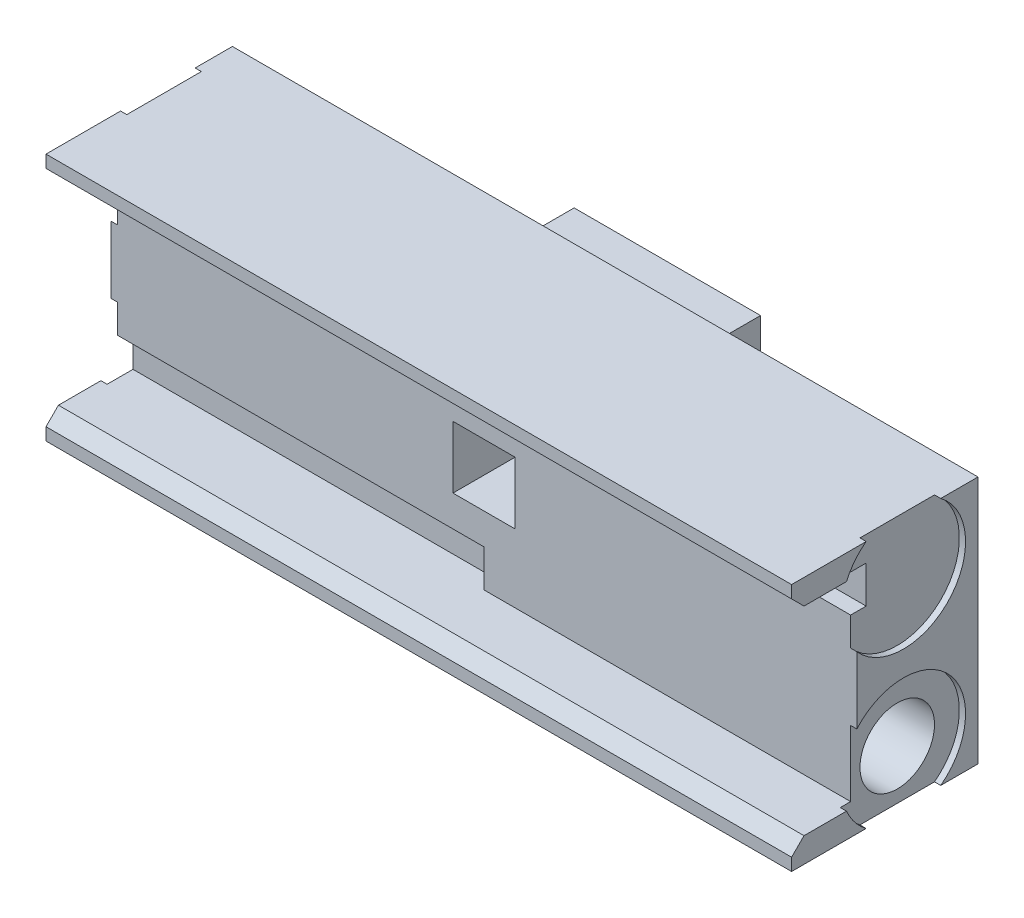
ISO-10303-21;
HEADER;
FILE_DESCRIPTION(('STEP AP214'),'2;1');
FILE_NAME('part.step','',(''),(''),'','','');
FILE_SCHEMA(('AUTOMOTIVE_DESIGN { 1 0 10303 214 1 1 1 1 }'));
ENDSEC;
DATA;
#1=APPLICATION_CONTEXT('core data for automotive mechanical design processes');
#2=APPLICATION_PROTOCOL_DEFINITION('international standard','automotive_design',2000,#1);
#3=PRODUCT_CONTEXT('',#1,'mechanical');
#4=PRODUCT('Part','Part','',(#3));
#5=PRODUCT_RELATED_PRODUCT_CATEGORY('part','',(#4));
#6=PRODUCT_DEFINITION_FORMATION('','',#4);
#7=PRODUCT_DEFINITION_CONTEXT('part definition',#1,'design');
#8=PRODUCT_DEFINITION('design','',#6,#7);
#9=PRODUCT_DEFINITION_SHAPE('','',#8);
#10=(LENGTH_UNIT() NAMED_UNIT(*) SI_UNIT(.MILLI.,.METRE.));
#11=(NAMED_UNIT(*) PLANE_ANGLE_UNIT() SI_UNIT($,.RADIAN.));
#12=(NAMED_UNIT(*) SI_UNIT($,.STERADIAN.) SOLID_ANGLE_UNIT());
#13=UNCERTAINTY_MEASURE_WITH_UNIT(LENGTH_MEASURE(1.E-05),#10,'distance_accuracy_value','');
#14=(GEOMETRIC_REPRESENTATION_CONTEXT(3) GLOBAL_UNCERTAINTY_ASSIGNED_CONTEXT((#13)) GLOBAL_UNIT_ASSIGNED_CONTEXT((#10,
#11,#12)) REPRESENTATION_CONTEXT('',''));
#15=CARTESIAN_POINT('',(0.,0.,0.));
#16=DIRECTION('',(0.,0.,1.));
#17=DIRECTION('',(1.,0.,0.));
#18=AXIS2_PLACEMENT_3D('',#15,#16,#17);
#19=CARTESIAN_POINT('',(-60.,20.,30.));
#20=DIRECTION('',(0.,-1.,0.));
#21=DIRECTION('',(0.,0.,-1.));
#22=AXIS2_PLACEMENT_3D('',#19,#20,#21);
#23=PLANE('',#22);
#24=DIRECTION('',(-1.,0.,0.));
#25=VECTOR('',#24,1.);
#26=CARTESIAN_POINT('',(-59.,20.,18.));
#27=LINE('',#26,#25);
#28=CARTESIAN_POINT('',(-60.,20.,18.));
#29=VERTEX_POINT('',#28);
#30=CARTESIAN_POINT('',(-59.,20.,18.));
#31=VERTEX_POINT('',#30);
#32=EDGE_CURVE('E373',#29,#31,#27,.F.);
#33=ORIENTED_EDGE('',*,*,#32,.F.);
#34=DIRECTION('',(0.,0.,-1.));
#35=VECTOR('',#34,1.);
#36=CARTESIAN_POINT('',(-60.,20.,30.));
#37=LINE('',#36,#35);
#38=CARTESIAN_POINT('',(-60.,20.,30.));
#39=VERTEX_POINT('',#38);
#40=EDGE_CURVE('E551',#39,#29,#37,.T.);
#41=ORIENTED_EDGE('',*,*,#40,.F.);
#42=DIRECTION('',(-1.,0.,0.));
#43=VECTOR('',#42,1.);
#44=CARTESIAN_POINT('',(-60.,20.,30.));
#45=LINE('',#44,#43);
#46=CARTESIAN_POINT('',(60.,20.,30.));
#47=VERTEX_POINT('',#46);
#48=EDGE_CURVE('E522',#47,#39,#45,.T.);
#49=ORIENTED_EDGE('',*,*,#48,.F.);
#50=DIRECTION('',(0.,0.,-1.));
#51=VECTOR('',#50,1.);
#52=CARTESIAN_POINT('',(60.,20.,30.));
#53=LINE('',#52,#51);
#54=CARTESIAN_POINT('',(60.,20.,18.));
#55=VERTEX_POINT('',#54);
#56=EDGE_CURVE('E555',#47,#55,#53,.T.);
#57=ORIENTED_EDGE('',*,*,#56,.T.);
#58=DIRECTION('',(1.,0.,0.));
#59=VECTOR('',#58,1.);
#60=CARTESIAN_POINT('',(59.,20.,18.));
#61=LINE('',#60,#59);
#62=CARTESIAN_POINT('',(59.,20.,18.));
#63=VERTEX_POINT('',#62);
#64=EDGE_CURVE('E419',#55,#63,#61,.F.);
#65=ORIENTED_EDGE('',*,*,#64,.T.);
#66=DIRECTION('',(0.,0.,1.));
#67=VECTOR('',#66,1.);
#68=CARTESIAN_POINT('',(59.,20.,30.));
#69=LINE('',#68,#67);
#70=CARTESIAN_POINT('',(59.,20.,6.00000000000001));
#71=VERTEX_POINT('',#70);
#72=EDGE_CURVE('E414',#71,#63,#69,.T.);
#73=ORIENTED_EDGE('',*,*,#72,.F.);
#74=DIRECTION('',(1.,0.,0.));
#75=VECTOR('',#74,1.);
#76=CARTESIAN_POINT('',(59.,20.,6.00000000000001));
#77=LINE('',#76,#75);
#78=CARTESIAN_POINT('',(60.,20.,6.00000000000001));
#79=VERTEX_POINT('',#78);
#80=EDGE_CURVE('E422',#71,#79,#77,.T.);
#81=ORIENTED_EDGE('',*,*,#80,.T.);
#82=CARTESIAN_POINT('',(60.,20.,0.));
#83=VERTEX_POINT('',#82);
#84=EDGE_CURVE('E554',#79,#83,#53,.T.);
#85=ORIENTED_EDGE('',*,*,#84,.T.);
#86=DIRECTION('',(-1.,0.,0.));
#87=VECTOR('',#86,1.);
#88=CARTESIAN_POINT('',(-60.,20.,0.));
#89=LINE('',#88,#87);
#90=CARTESIAN_POINT('',(-60.,20.,0.));
#91=VERTEX_POINT('',#90);
#92=EDGE_CURVE('E534',#83,#91,#89,.T.);
#93=ORIENTED_EDGE('',*,*,#92,.T.);
#94=CARTESIAN_POINT('',(-60.,20.,6.00000000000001));
#95=VERTEX_POINT('',#94);
#96=EDGE_CURVE('E550',#95,#91,#37,.T.);
#97=ORIENTED_EDGE('',*,*,#96,.F.);
#98=DIRECTION('',(-1.,0.,0.));
#99=VECTOR('',#98,1.);
#100=CARTESIAN_POINT('',(-59.,20.,6.00000000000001));
#101=LINE('',#100,#99);
#102=CARTESIAN_POINT('',(-59.,20.,6.00000000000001));
#103=VERTEX_POINT('',#102);
#104=EDGE_CURVE('E371',#103,#95,#101,.T.);
#105=ORIENTED_EDGE('',*,*,#104,.F.);
#106=DIRECTION('',(0.,0.,-1.));
#107=VECTOR('',#106,1.);
#108=CARTESIAN_POINT('',(-59.,20.,30.));
#109=LINE('',#108,#107);
#110=EDGE_CURVE('E366',#31,#103,#109,.T.);
#111=ORIENTED_EDGE('',*,*,#110,.F.);
#112=EDGE_LOOP('',(#33,#41,#49,#57,#65,#73,#81,#85,#93,#97,#105,#111));
#113=FACE_BOUND('',#112,.T.);
#114=ADVANCED_FACE('F32',(#113),#23,.F.);
#115=CARTESIAN_POINT('',(-60.,-20.,30.));
#116=DIRECTION('',(1.,0.,0.));
#117=DIRECTION('',(0.,0.,-1.));
#118=AXIS2_PLACEMENT_3D('',#115,#116,#117);
#119=PLANE('',#118);
#120=DIRECTION('',(0.,0.,-1.));
#121=VECTOR('',#120,1.);
#122=CARTESIAN_POINT('',(-60.,16.,30.));
#123=LINE('',#122,#121);
#124=CARTESIAN_POINT('',(-60.,16.,28.));
#125=VERTEX_POINT('',#124);
#126=CARTESIAN_POINT('',(-60.,16.,21.1651513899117));
#127=VERTEX_POINT('',#126);
#128=EDGE_CURVE('E458',#125,#127,#123,.T.);
#129=ORIENTED_EDGE('',*,*,#128,.F.);
#130=DIRECTION('',(0.,-0.707106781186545,-0.70710678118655));
#131=VECTOR('',#130,1.);
#132=CARTESIAN_POINT('',(-60.,18.,30.));
#133=LINE('',#132,#131);
#134=CARTESIAN_POINT('',(-60.,18.,30.));
#135=VERTEX_POINT('',#134);
#136=EDGE_CURVE('E584',#125,#135,#133,.F.);
#137=ORIENTED_EDGE('',*,*,#136,.T.);
#138=DIRECTION('',(0.,-1.,0.));
#139=VECTOR('',#138,1.);
#140=CARTESIAN_POINT('',(-60.,-20.,30.));
#141=LINE('',#140,#139);
#142=EDGE_CURVE('E526',#39,#135,#141,.T.);
#143=ORIENTED_EDGE('',*,*,#142,.F.);
#144=ORIENTED_EDGE('',*,*,#40,.T.);
#145=CARTESIAN_POINT('',(-60.,12.,12.));
#146=DIRECTION('',(1.,0.,0.));
#147=DIRECTION('',(0.,0.,-1.));
#148=AXIS2_PLACEMENT_3D('',#145,#146,#147);
#149=CIRCLE('',#148,10.);
#150=EDGE_CURVE('E339',#29,#127,#149,.T.);
#151=ORIENTED_EDGE('',*,*,#150,.T.);
#152=EDGE_LOOP('',(#129,#137,#143,#144,#151));
#153=FACE_BOUND('',#152,.T.);
#154=ADVANCED_FACE('F659',(#153),#119,.F.);
#155=CARTESIAN_POINT('',(-60.,-18.,30.));
#156=VERTEX_POINT('',#155);
#157=CARTESIAN_POINT('',(-60.,-20.,30.));
#158=VERTEX_POINT('',#157);
#159=EDGE_CURVE('E525',#156,#158,#141,.T.);
#160=ORIENTED_EDGE('',*,*,#159,.F.);
#161=DIRECTION('',(0.,-0.70710678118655,0.707106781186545));
#162=VECTOR('',#161,1.);
#163=CARTESIAN_POINT('',(-60.,-16.,28.));
#164=LINE('',#163,#162);
#165=CARTESIAN_POINT('',(-60.,-16.,28.));
#166=VERTEX_POINT('',#165);
#167=EDGE_CURVE('E11',#156,#166,#164,.F.);
#168=ORIENTED_EDGE('',*,*,#167,.T.);
#169=DIRECTION('',(0.,0.,1.));
#170=VECTOR('',#169,1.);
#171=CARTESIAN_POINT('',(-60.,-16.,30.));
#172=LINE('',#171,#170);
#173=CARTESIAN_POINT('',(-60.,-16.,21.1651513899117));
#174=VERTEX_POINT('',#173);
#175=EDGE_CURVE('E462',#174,#166,#172,.T.);
#176=ORIENTED_EDGE('',*,*,#175,.F.);
#177=CARTESIAN_POINT('',(-60.,-12.,12.));
#178=DIRECTION('',(1.,0.,0.));
#179=DIRECTION('',(0.,0.,-1.));
#180=AXIS2_PLACEMENT_3D('',#177,#178,#179);
#181=CIRCLE('',#180,10.);
#182=CARTESIAN_POINT('',(-60.,-20.,18.));
#183=VERTEX_POINT('',#182);
#184=EDGE_CURVE('E347',#174,#183,#181,.T.);
#185=ORIENTED_EDGE('',*,*,#184,.T.);
#186=DIRECTION('',(0.,0.,-1.));
#187=VECTOR('',#186,1.);
#188=CARTESIAN_POINT('',(-60.,-20.,30.));
#189=LINE('',#188,#187);
#190=EDGE_CURVE('E547',#158,#183,#189,.T.);
#191=ORIENTED_EDGE('',*,*,#190,.F.);
#192=EDGE_LOOP('',(#160,#168,#176,#185,#191));
#193=FACE_BOUND('',#192,.T.);
#194=ADVANCED_FACE('F710',(#193),#119,.F.);
#195=CARTESIAN_POINT('',(-60.,-20.,30.));
#196=DIRECTION('',(0.,1.,0.));
#197=DIRECTION('',(0.,0.,1.));
#198=AXIS2_PLACEMENT_3D('',#195,#196,#197);
#199=PLANE('',#198);
#200=DIRECTION('',(-1.,0.,0.));
#201=VECTOR('',#200,1.);
#202=CARTESIAN_POINT('',(-59.,-20.,5.99999999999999));
#203=LINE('',#202,#201);
#204=CARTESIAN_POINT('',(-60.,-20.,5.99999999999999));
#205=VERTEX_POINT('',#204);
#206=CARTESIAN_POINT('',(-59.,-20.,5.99999999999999));
#207=VERTEX_POINT('',#206);
#208=EDGE_CURVE('E362',#205,#207,#203,.F.);
#209=ORIENTED_EDGE('',*,*,#208,.F.);
#210=CARTESIAN_POINT('',(-60.,-20.,0.));
#211=VERTEX_POINT('',#210);
#212=EDGE_CURVE('E546',#205,#211,#189,.T.);
#213=ORIENTED_EDGE('',*,*,#212,.T.);
#214=DIRECTION('',(1.,0.,0.));
#215=VECTOR('',#214,1.);
#216=CARTESIAN_POINT('',(-60.,-20.,0.));
#217=LINE('',#216,#215);
#218=CARTESIAN_POINT('',(60.,-20.,0.));
#219=VERTEX_POINT('',#218);
#220=EDGE_CURVE('E540',#211,#219,#217,.T.);
#221=ORIENTED_EDGE('',*,*,#220,.T.);
#222=DIRECTION('',(0.,0.,-1.));
#223=VECTOR('',#222,1.);
#224=CARTESIAN_POINT('',(60.,-20.,30.));
#225=LINE('',#224,#223);
#226=CARTESIAN_POINT('',(60.,-20.,5.99999999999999));
#227=VERTEX_POINT('',#226);
#228=EDGE_CURVE('E531',#227,#219,#225,.T.);
#229=ORIENTED_EDGE('',*,*,#228,.F.);
#230=DIRECTION('',(1.,0.,0.));
#231=VECTOR('',#230,1.);
#232=CARTESIAN_POINT('',(59.,-20.,5.99999999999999));
#233=LINE('',#232,#231);
#234=CARTESIAN_POINT('',(59.,-20.,5.99999999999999));
#235=VERTEX_POINT('',#234);
#236=EDGE_CURVE('E402',#227,#235,#233,.F.);
#237=ORIENTED_EDGE('',*,*,#236,.T.);
#238=DIRECTION('',(0.,0.,-1.));
#239=VECTOR('',#238,1.);
#240=CARTESIAN_POINT('',(59.,-20.,30.));
#241=LINE('',#240,#239);
#242=CARTESIAN_POINT('',(59.,-20.,18.));
#243=VERTEX_POINT('',#242);
#244=EDGE_CURVE('E397',#243,#235,#241,.T.);
#245=ORIENTED_EDGE('',*,*,#244,.F.);
#246=DIRECTION('',(1.,0.,0.));
#247=VECTOR('',#246,1.);
#248=CARTESIAN_POINT('',(59.,-20.,18.));
#249=LINE('',#248,#247);
#250=CARTESIAN_POINT('',(60.,-20.,18.));
#251=VERTEX_POINT('',#250);
#252=EDGE_CURVE('E405',#243,#251,#249,.T.);
#253=ORIENTED_EDGE('',*,*,#252,.T.);
#254=CARTESIAN_POINT('',(60.,-20.,30.));
#255=VERTEX_POINT('',#254);
#256=EDGE_CURVE('E543',#255,#251,#225,.T.);
#257=ORIENTED_EDGE('',*,*,#256,.F.);
#258=DIRECTION('',(1.,0.,0.));
#259=VECTOR('',#258,1.);
#260=CARTESIAN_POINT('',(-60.,-20.,30.));
#261=LINE('',#260,#259);
#262=EDGE_CURVE('E529',#158,#255,#261,.T.);
#263=ORIENTED_EDGE('',*,*,#262,.F.);
#264=ORIENTED_EDGE('',*,*,#190,.T.);
#265=DIRECTION('',(-1.,0.,0.));
#266=VECTOR('',#265,1.);
#267=CARTESIAN_POINT('',(-59.,-20.,18.));
#268=LINE('',#267,#266);
#269=CARTESIAN_POINT('',(-59.,-20.,18.));
#270=VERTEX_POINT('',#269);
#271=EDGE_CURVE('E360',#270,#183,#268,.T.);
#272=ORIENTED_EDGE('',*,*,#271,.F.);
#273=DIRECTION('',(0.,0.,1.));
#274=VECTOR('',#273,1.);
#275=CARTESIAN_POINT('',(-59.,-20.,30.));
#276=LINE('',#275,#274);
#277=EDGE_CURVE('E356',#207,#270,#276,.T.);
#278=ORIENTED_EDGE('',*,*,#277,.F.);
#279=EDGE_LOOP('',(#209,#213,#221,#229,#237,#245,#253,#257,#263,#264,#272,#278));
#280=FACE_BOUND('',#279,.T.);
#281=ADVANCED_FACE('F607',(#280),#199,.F.);
#282=CARTESIAN_POINT('',(0.,16.,30.));
#283=DIRECTION('',(0.,1.,0.));
#284=DIRECTION('',(0.,0.,1.));
#285=AXIS2_PLACEMENT_3D('',#282,#283,#284);
#286=PLANE('',#285);
#287=DIRECTION('',(0.,0.,1.));
#288=VECTOR('',#287,1.);
#289=CARTESIAN_POINT('',(60.,16.,30.));
#290=LINE('',#289,#288);
#291=CARTESIAN_POINT('',(60.,16.,21.1651513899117));
#292=VERTEX_POINT('',#291);
#293=CARTESIAN_POINT('',(60.,16.,28.));
#294=VERTEX_POINT('',#293);
#295=EDGE_CURVE('E492',#292,#294,#290,.T.);
#296=ORIENTED_EDGE('',*,*,#295,.T.);
#297=DIRECTION('',(-1.,0.,0.));
#298=VECTOR('',#297,1.);
#299=CARTESIAN_POINT('',(0.,16.,28.));
#300=LINE('',#299,#298);
#301=EDGE_CURVE('E582',#294,#125,#300,.T.);
#302=ORIENTED_EDGE('',*,*,#301,.T.);
#303=ORIENTED_EDGE('',*,*,#128,.T.);
#304=DIRECTION('',(-1.,0.,0.));
#305=VECTOR('',#304,1.);
#306=CARTESIAN_POINT('',(-59.,16.,21.1651513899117));
#307=LINE('',#306,#305);
#308=CARTESIAN_POINT('',(-59.,16.,21.1651513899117));
#309=VERTEX_POINT('',#308);
#310=EDGE_CURVE('E368',#309,#127,#307,.T.);
#311=ORIENTED_EDGE('',*,*,#310,.F.);
#312=DIRECTION('',(0.,0.,1.));
#313=VECTOR('',#312,1.);
#314=CARTESIAN_POINT('',(-59.,16.,30.));
#315=LINE('',#314,#313);
#316=CARTESIAN_POINT('',(-59.,16.,19.5));
#317=VERTEX_POINT('',#316);
#318=EDGE_CURVE('E364',#317,#309,#315,.T.);
#319=ORIENTED_EDGE('',*,*,#318,.F.);
#320=DIRECTION('',(-1.,0.,0.));
#321=VECTOR('',#320,1.);
#322=CARTESIAN_POINT('',(0.,16.,19.5));
#323=LINE('',#322,#321);
#324=CARTESIAN_POINT('',(0.,16.,19.5));
#325=VERTEX_POINT('',#324);
#326=EDGE_CURVE('E470',#325,#317,#323,.T.);
#327=ORIENTED_EDGE('',*,*,#326,.F.);
#328=DIRECTION('',(0.,0.,1.));
#329=VECTOR('',#328,1.);
#330=CARTESIAN_POINT('',(0.,16.,19.7820675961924));
#331=LINE('',#330,#329);
#332=CARTESIAN_POINT('',(0.,16.,17.));
#333=VERTEX_POINT('',#332);
#334=EDGE_CURVE('E498',#333,#325,#331,.T.);
#335=ORIENTED_EDGE('',*,*,#334,.F.);
#336=DIRECTION('',(1.,0.,0.));
#337=VECTOR('',#336,1.);
#338=CARTESIAN_POINT('',(0.,16.,17.));
#339=LINE('',#338,#337);
#340=CARTESIAN_POINT('',(59.,16.,17.));
#341=VERTEX_POINT('',#340);
#342=EDGE_CURVE('E508',#333,#341,#339,.T.);
#343=ORIENTED_EDGE('',*,*,#342,.T.);
#344=DIRECTION('',(0.,0.,-1.));
#345=VECTOR('',#344,1.);
#346=CARTESIAN_POINT('',(59.,16.,30.));
#347=LINE('',#346,#345);
#348=CARTESIAN_POINT('',(59.,16.,21.1651513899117));
#349=VERTEX_POINT('',#348);
#350=EDGE_CURVE('E412',#349,#341,#347,.T.);
#351=ORIENTED_EDGE('',*,*,#350,.F.);
#352=DIRECTION('',(1.,0.,0.));
#353=VECTOR('',#352,1.);
#354=CARTESIAN_POINT('',(59.,16.,21.1651513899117));
#355=LINE('',#354,#353);
#356=EDGE_CURVE('E416',#349,#292,#355,.T.);
#357=ORIENTED_EDGE('',*,*,#356,.T.);
#358=EDGE_LOOP('',(#296,#302,#303,#311,#319,#327,#335,#343,#351,#357));
#359=FACE_BOUND('',#358,.T.);
#360=ADVANCED_FACE('F642',(#359),#286,.F.);
#361=CARTESIAN_POINT('',(0.,10.,19.5));
#362=DIRECTION('',(0.,0.,-1.));
#363=DIRECTION('',(0.,1.,0.));
#364=AXIS2_PLACEMENT_3D('',#361,#362,#363);
#365=PLANE('',#364);
#366=DIRECTION('',(-1.,0.,0.));
#367=VECTOR('',#366,1.);
#368=CARTESIAN_POINT('',(-5.,5.,19.5));
#369=LINE('',#368,#367);
#370=CARTESIAN_POINT('',(5.,5.,19.5));
#371=VERTEX_POINT('',#370);
#372=CARTESIAN_POINT('',(-5.,5.,19.5));
#373=VERTEX_POINT('',#372);
#374=EDGE_CURVE('E324',#371,#373,#369,.T.);
#375=ORIENTED_EDGE('',*,*,#374,.F.);
#376=DIRECTION('',(0.,1.,0.));
#377=VECTOR('',#376,1.);
#378=CARTESIAN_POINT('',(5.,-5.,19.5));
#379=LINE('',#378,#377);
#380=CARTESIAN_POINT('',(5.,-5.,19.5));
#381=VERTEX_POINT('',#380);
#382=EDGE_CURVE('E295',#381,#371,#379,.T.);
#383=ORIENTED_EDGE('',*,*,#382,.F.);
#384=DIRECTION('',(1.,0.,0.));
#385=VECTOR('',#384,1.);
#386=CARTESIAN_POINT('',(-5.,-5.,19.5));
#387=LINE('',#386,#385);
#388=CARTESIAN_POINT('',(-5.,-5.,19.5));
#389=VERTEX_POINT('',#388);
#390=EDGE_CURVE('E312',#389,#381,#387,.T.);
#391=ORIENTED_EDGE('',*,*,#390,.F.);
#392=DIRECTION('',(0.,-1.,0.));
#393=VECTOR('',#392,1.);
#394=CARTESIAN_POINT('',(-5.,-5.,19.5));
#395=LINE('',#394,#393);
#396=EDGE_CURVE('E315',#373,#389,#395,.T.);
#397=ORIENTED_EDGE('',*,*,#396,.F.);
#398=EDGE_LOOP('',(#375,#383,#391,#397));
#399=FACE_BOUND('',#398,.T.);
#400=DIRECTION('',(-1.,0.,0.));
#401=VECTOR('',#400,1.);
#402=CARTESIAN_POINT('',(-59.,5.38562172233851,19.5));
#403=LINE('',#402,#401);
#404=CARTESIAN_POINT('',(-60.,5.38562172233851,19.5));
#405=VERTEX_POINT('',#404);
#406=CARTESIAN_POINT('',(-59.,5.38562172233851,19.5));
#407=VERTEX_POINT('',#406);
#408=EDGE_CURVE('E574',#405,#407,#403,.F.);
#409=ORIENTED_EDGE('',*,*,#408,.F.);
#410=DIRECTION('',(0.,-1.,0.));
#411=VECTOR('',#410,1.);
#412=CARTESIAN_POINT('',(-60.,16.,19.5));
#413=LINE('',#412,#411);
#414=CARTESIAN_POINT('',(-60.,-5.38562172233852,19.5));
#415=VERTEX_POINT('',#414);
#416=EDGE_CURVE('E472',#405,#415,#413,.T.);
#417=ORIENTED_EDGE('',*,*,#416,.T.);
#418=DIRECTION('',(-1.,0.,0.));
#419=VECTOR('',#418,1.);
#420=CARTESIAN_POINT('',(-59.,-5.38562172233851,19.5));
#421=LINE('',#420,#419);
#422=CARTESIAN_POINT('',(-59.,-5.38562172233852,19.5));
#423=VERTEX_POINT('',#422);
#424=EDGE_CURVE('E358',#423,#415,#421,.T.);
#425=ORIENTED_EDGE('',*,*,#424,.F.);
#426=DIRECTION('',(0.,1.,0.));
#427=VECTOR('',#426,1.);
#428=CARTESIAN_POINT('',(-59.,10.,19.5));
#429=LINE('',#428,#427);
#430=CARTESIAN_POINT('',(-59.,-10.,19.5));
#431=VERTEX_POINT('',#430);
#432=EDGE_CURVE('E354',#431,#423,#429,.T.);
#433=ORIENTED_EDGE('',*,*,#432,.F.);
#434=DIRECTION('',(-1.,0.,0.));
#435=VECTOR('',#434,1.);
#436=CARTESIAN_POINT('',(0.,-10.,19.5));
#437=LINE('',#436,#435);
#438=CARTESIAN_POINT('',(0.,-10.,19.5));
#439=VERTEX_POINT('',#438);
#440=EDGE_CURVE('E484',#439,#431,#437,.T.);
#441=ORIENTED_EDGE('',*,*,#440,.F.);
#442=DIRECTION('',(0.,1.,0.));
#443=VECTOR('',#442,1.);
#444=CARTESIAN_POINT('',(0.,10.,19.5));
#445=LINE('',#444,#443);
#446=CARTESIAN_POINT('',(0.,-16.,19.5));
#447=VERTEX_POINT('',#446);
#448=EDGE_CURVE('E489',#447,#439,#445,.T.);
#449=ORIENTED_EDGE('',*,*,#448,.F.);
#450=DIRECTION('',(1.,0.,0.));
#451=VECTOR('',#450,1.);
#452=CARTESIAN_POINT('',(0.,-16.,19.5));
#453=LINE('',#452,#451);
#454=CARTESIAN_POINT('',(59.,-16.,19.5));
#455=VERTEX_POINT('',#454);
#456=EDGE_CURVE('E501',#447,#455,#453,.T.);
#457=ORIENTED_EDGE('',*,*,#456,.T.);
#458=DIRECTION('',(0.,-1.,0.));
#459=VECTOR('',#458,1.);
#460=CARTESIAN_POINT('',(59.,10.,19.5));
#461=LINE('',#460,#459);
#462=CARTESIAN_POINT('',(59.,-5.38562172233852,19.5));
#463=VERTEX_POINT('',#462);
#464=EDGE_CURVE('E395',#463,#455,#461,.T.);
#465=ORIENTED_EDGE('',*,*,#464,.F.);
#466=DIRECTION('',(1.,0.,0.));
#467=VECTOR('',#466,1.);
#468=CARTESIAN_POINT('',(59.,-5.38562172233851,19.5));
#469=LINE('',#468,#467);
#470=CARTESIAN_POINT('',(60.,-5.38562172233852,19.5));
#471=VERTEX_POINT('',#470);
#472=EDGE_CURVE('E399',#463,#471,#469,.T.);
#473=ORIENTED_EDGE('',*,*,#472,.T.);
#474=DIRECTION('',(0.,1.,0.));
#475=VECTOR('',#474,1.);
#476=CARTESIAN_POINT('',(60.,10.,19.5));
#477=LINE('',#476,#475);
#478=CARTESIAN_POINT('',(60.,5.38562172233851,19.5));
#479=VERTEX_POINT('',#478);
#480=EDGE_CURVE('E503',#471,#479,#477,.T.);
#481=ORIENTED_EDGE('',*,*,#480,.T.);
#482=DIRECTION('',(1.,0.,0.));
#483=VECTOR('',#482,1.);
#484=CARTESIAN_POINT('',(59.,5.38562172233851,19.5));
#485=LINE('',#484,#483);
#486=CARTESIAN_POINT('',(59.,5.38562172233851,19.5));
#487=VERTEX_POINT('',#486);
#488=EDGE_CURVE('E565',#479,#487,#485,.F.);
#489=ORIENTED_EDGE('',*,*,#488,.T.);
#490=DIRECTION('',(0.,-1.,0.));
#491=VECTOR('',#490,1.);
#492=CARTESIAN_POINT('',(59.,10.,19.5));
#493=LINE('',#492,#491);
#494=CARTESIAN_POINT('',(59.,10.,19.5));
#495=VERTEX_POINT('',#494);
#496=EDGE_CURVE('E563',#495,#487,#493,.T.);
#497=ORIENTED_EDGE('',*,*,#496,.F.);
#498=DIRECTION('',(1.,0.,0.));
#499=VECTOR('',#498,1.);
#500=CARTESIAN_POINT('',(0.,10.,19.5));
#501=LINE('',#500,#499);
#502=CARTESIAN_POINT('',(0.,10.,19.5));
#503=VERTEX_POINT('',#502);
#504=EDGE_CURVE('E515',#503,#495,#501,.T.);
#505=ORIENTED_EDGE('',*,*,#504,.F.);
#506=DIRECTION('',(0.,-1.,0.));
#507=VECTOR('',#506,1.);
#508=CARTESIAN_POINT('',(0.,16.,19.5));
#509=LINE('',#508,#507);
#510=EDGE_CURVE('E459',#325,#503,#509,.T.);
#511=ORIENTED_EDGE('',*,*,#510,.F.);
#512=ORIENTED_EDGE('',*,*,#326,.T.);
#513=DIRECTION('',(0.,1.,0.));
#514=VECTOR('',#513,1.);
#515=CARTESIAN_POINT('',(-59.,10.,19.5));
#516=LINE('',#515,#514);
#517=EDGE_CURVE('E572',#407,#317,#516,.T.);
#518=ORIENTED_EDGE('',*,*,#517,.F.);
#519=EDGE_LOOP('',(#409,#417,#425,#433,#441,#449,#457,#465,#473,#481,#489,#497,#505,#511,#512,#518));
#520=FACE_BOUND('',#519,.T.);
#521=ADVANCED_FACE('F620',(#399,#520),#365,.F.);
#522=CARTESIAN_POINT('',(0.,-16.,30.));
#523=DIRECTION('',(0.,-1.,0.));
#524=DIRECTION('',(0.,0.,-1.));
#525=AXIS2_PLACEMENT_3D('',#522,#523,#524);
#526=PLANE('',#525);
#527=ORIENTED_EDGE('',*,*,#175,.T.);
#528=DIRECTION('',(1.,0.,0.));
#529=VECTOR('',#528,1.);
#530=CARTESIAN_POINT('',(0.,-16.,28.));
#531=LINE('',#530,#529);
#532=CARTESIAN_POINT('',(60.,-16.,28.));
#533=VERTEX_POINT('',#532);
#534=EDGE_CURVE('E586',#166,#533,#531,.T.);
#535=ORIENTED_EDGE('',*,*,#534,.T.);
#536=DIRECTION('',(0.,0.,-1.));
#537=VECTOR('',#536,1.);
#538=CARTESIAN_POINT('',(60.,-16.,30.));
#539=LINE('',#538,#537);
#540=CARTESIAN_POINT('',(60.,-16.,21.1651513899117));
#541=VERTEX_POINT('',#540);
#542=EDGE_CURVE('E480',#533,#541,#539,.T.);
#543=ORIENTED_EDGE('',*,*,#542,.T.);
#544=DIRECTION('',(1.,0.,0.));
#545=VECTOR('',#544,1.);
#546=CARTESIAN_POINT('',(59.,-16.,21.1651513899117));
#547=LINE('',#546,#545);
#548=CARTESIAN_POINT('',(59.,-16.,21.1651513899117));
#549=VERTEX_POINT('',#548);
#550=EDGE_CURVE('E560',#541,#549,#547,.F.);
#551=ORIENTED_EDGE('',*,*,#550,.T.);
#552=DIRECTION('',(0.,0.,1.));
#553=VECTOR('',#552,1.);
#554=CARTESIAN_POINT('',(59.,-16.,30.));
#555=LINE('',#554,#553);
#556=EDGE_CURVE('E558',#455,#549,#555,.T.);
#557=ORIENTED_EDGE('',*,*,#556,.F.);
#558=ORIENTED_EDGE('',*,*,#456,.F.);
#559=DIRECTION('',(0.,0.,1.));
#560=VECTOR('',#559,1.);
#561=CARTESIAN_POINT('',(0.,-16.,18.436994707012));
#562=LINE('',#561,#560);
#563=CARTESIAN_POINT('',(0.,-16.,17.));
#564=VERTEX_POINT('',#563);
#565=EDGE_CURVE('E468',#564,#447,#562,.T.);
#566=ORIENTED_EDGE('',*,*,#565,.F.);
#567=DIRECTION('',(-1.,0.,0.));
#568=VECTOR('',#567,1.);
#569=CARTESIAN_POINT('',(0.,-16.,17.));
#570=LINE('',#569,#568);
#571=CARTESIAN_POINT('',(-59.,-16.,17.));
#572=VERTEX_POINT('',#571);
#573=EDGE_CURVE('E477',#564,#572,#570,.T.);
#574=ORIENTED_EDGE('',*,*,#573,.T.);
#575=DIRECTION('',(0.,0.,-1.));
#576=VECTOR('',#575,1.);
#577=CARTESIAN_POINT('',(-59.,-16.,30.));
#578=LINE('',#577,#576);
#579=CARTESIAN_POINT('',(-59.,-16.,21.1651513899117));
#580=VERTEX_POINT('',#579);
#581=EDGE_CURVE('E352',#580,#572,#578,.T.);
#582=ORIENTED_EDGE('',*,*,#581,.F.);
#583=DIRECTION('',(-1.,0.,0.));
#584=VECTOR('',#583,1.);
#585=CARTESIAN_POINT('',(-59.,-16.,21.1651513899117));
#586=LINE('',#585,#584);
#587=EDGE_CURVE('E570',#174,#580,#586,.F.);
#588=ORIENTED_EDGE('',*,*,#587,.F.);
#589=EDGE_LOOP('',(#527,#535,#543,#551,#557,#558,#566,#574,#582,#588));
#590=FACE_BOUND('',#589,.T.);
#591=ADVANCED_FACE('F591',(#590),#526,.F.);
#592=CARTESIAN_POINT('',(0.,-16.,17.));
#593=DIRECTION('',(0.,0.,-1.));
#594=DIRECTION('',(-1.,0.,0.));
#595=AXIS2_PLACEMENT_3D('',#592,#593,#594);
#596=PLANE('',#595);
#597=DIRECTION('',(0.,1.,0.));
#598=VECTOR('',#597,1.);
#599=CARTESIAN_POINT('',(-59.,-16.,17.));
#600=LINE('',#599,#598);
#601=CARTESIAN_POINT('',(-59.,-10.,17.));
#602=VERTEX_POINT('',#601);
#603=EDGE_CURVE('E350',#572,#602,#600,.T.);
#604=ORIENTED_EDGE('',*,*,#603,.F.);
#605=ORIENTED_EDGE('',*,*,#573,.F.);
#606=DIRECTION('',(0.,-1.,0.));
#607=VECTOR('',#606,1.);
#608=CARTESIAN_POINT('',(0.,-16.,17.));
#609=LINE('',#608,#607);
#610=CARTESIAN_POINT('',(0.,-10.,17.));
#611=VERTEX_POINT('',#610);
#612=EDGE_CURVE('E465',#611,#564,#609,.T.);
#613=ORIENTED_EDGE('',*,*,#612,.F.);
#614=DIRECTION('',(-1.,0.,0.));
#615=VECTOR('',#614,1.);
#616=CARTESIAN_POINT('',(0.,-10.,17.));
#617=LINE('',#616,#615);
#618=EDGE_CURVE('E481',#611,#602,#617,.T.);
#619=ORIENTED_EDGE('',*,*,#618,.T.);
#620=EDGE_LOOP('',(#604,#605,#613,#619));
#621=FACE_BOUND('',#620,.T.);
#622=ADVANCED_FACE('F794',(#621),#596,.F.);
#623=CARTESIAN_POINT('',(0.,-10.,19.5));
#624=DIRECTION('',(0.,1.,0.));
#625=DIRECTION('',(0.,0.,1.));
#626=AXIS2_PLACEMENT_3D('',#623,#624,#625);
#627=PLANE('',#626);
#628=DIRECTION('',(0.,0.,1.));
#629=VECTOR('',#628,1.);
#630=CARTESIAN_POINT('',(-59.,-10.,19.5));
#631=LINE('',#630,#629);
#632=EDGE_CURVE('E568',#602,#431,#631,.T.);
#633=ORIENTED_EDGE('',*,*,#632,.F.);
#634=ORIENTED_EDGE('',*,*,#618,.F.);
#635=DIRECTION('',(0.,0.,-1.));
#636=VECTOR('',#635,1.);
#637=CARTESIAN_POINT('',(0.,-10.,19.5));
#638=LINE('',#637,#636);
#639=EDGE_CURVE('E461',#439,#611,#638,.T.);
#640=ORIENTED_EDGE('',*,*,#639,.F.);
#641=ORIENTED_EDGE('',*,*,#440,.T.);
#642=EDGE_LOOP('',(#633,#634,#640,#641));
#643=FACE_BOUND('',#642,.T.);
#644=ADVANCED_FACE('F797',(#643),#627,.F.);
#645=CARTESIAN_POINT('',(60.,-20.,30.));
#646=DIRECTION('',(-1.,0.,0.));
#647=DIRECTION('',(0.,0.,1.));
#648=AXIS2_PLACEMENT_3D('',#645,#646,#647);
#649=PLANE('',#648);
#650=DIRECTION('',(0.,1.,0.));
#651=VECTOR('',#650,1.);
#652=CARTESIAN_POINT('',(60.,-20.,30.));
#653=LINE('',#652,#651);
#654=CARTESIAN_POINT('',(60.,18.,30.));
#655=VERTEX_POINT('',#654);
#656=EDGE_CURVE('E523',#655,#47,#653,.T.);
#657=ORIENTED_EDGE('',*,*,#656,.F.);
#658=DIRECTION('',(0.,0.707106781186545,0.70710678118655));
#659=VECTOR('',#658,1.);
#660=CARTESIAN_POINT('',(60.,18.,30.));
#661=LINE('',#660,#659);
#662=EDGE_CURVE('E580',#655,#294,#661,.F.);
#663=ORIENTED_EDGE('',*,*,#662,.T.);
#664=ORIENTED_EDGE('',*,*,#295,.F.);
#665=CARTESIAN_POINT('',(60.,12.,12.));
#666=DIRECTION('',(1.,0.,0.));
#667=DIRECTION('',(0.,0.,-1.));
#668=AXIS2_PLACEMENT_3D('',#665,#666,#667);
#669=CIRCLE('',#668,10.);
#670=EDGE_CURVE('E386',#55,#292,#669,.T.);
#671=ORIENTED_EDGE('',*,*,#670,.F.);
#672=ORIENTED_EDGE('',*,*,#56,.F.);
#673=EDGE_LOOP('',(#657,#663,#664,#671,#672));
#674=FACE_BOUND('',#673,.T.);
#675=ADVANCED_FACE('F646',(#674),#649,.F.);
#676=ORIENTED_EDGE('',*,*,#84,.F.);
#677=EDGE_CURVE('E387',#479,#79,#669,.T.);
#678=ORIENTED_EDGE('',*,*,#677,.F.);
#679=ORIENTED_EDGE('',*,*,#480,.F.);
#680=CARTESIAN_POINT('',(60.,-12.,12.));
#681=DIRECTION('',(1.,0.,0.));
#682=DIRECTION('',(0.,0.,-1.));
#683=AXIS2_PLACEMENT_3D('',#680,#681,#682);
#684=CIRCLE('',#683,10.);
#685=EDGE_CURVE('E379',#227,#471,#684,.T.);
#686=ORIENTED_EDGE('',*,*,#685,.F.);
#687=ORIENTED_EDGE('',*,*,#228,.T.);
#688=DIRECTION('',(0.,1.,0.));
#689=VECTOR('',#688,1.);
#690=CARTESIAN_POINT('',(60.,-20.,0.));
#691=LINE('',#690,#689);
#692=EDGE_CURVE('E511',#219,#83,#691,.T.);
#693=ORIENTED_EDGE('',*,*,#692,.T.);
#694=EDGE_LOOP('',(#676,#678,#679,#686,#687,#693));
#695=FACE_BOUND('',#694,.T.);
#696=ADVANCED_FACE('F624',(#695),#649,.F.);
#697=CARTESIAN_POINT('',(0.,16.,17.));
#698=DIRECTION('',(0.,0.,-1.));
#699=DIRECTION('',(0.,1.,0.));
#700=AXIS2_PLACEMENT_3D('',#697,#698,#699);
#701=PLANE('',#700);
#702=DIRECTION('',(0.,-1.,0.));
#703=VECTOR('',#702,1.);
#704=CARTESIAN_POINT('',(59.,16.,17.));
#705=LINE('',#704,#703);
#706=CARTESIAN_POINT('',(59.,10.,17.));
#707=VERTEX_POINT('',#706);
#708=EDGE_CURVE('E410',#341,#707,#705,.T.);
#709=ORIENTED_EDGE('',*,*,#708,.F.);
#710=ORIENTED_EDGE('',*,*,#342,.F.);
#711=DIRECTION('',(0.,1.,0.));
#712=VECTOR('',#711,1.);
#713=CARTESIAN_POINT('',(0.,16.,17.));
#714=LINE('',#713,#712);
#715=CARTESIAN_POINT('',(0.,10.,17.));
#716=VERTEX_POINT('',#715);
#717=EDGE_CURVE('E495',#716,#333,#714,.T.);
#718=ORIENTED_EDGE('',*,*,#717,.F.);
#719=DIRECTION('',(1.,0.,0.));
#720=VECTOR('',#719,1.);
#721=CARTESIAN_POINT('',(0.,10.,17.));
#722=LINE('',#721,#720);
#723=EDGE_CURVE('E512',#716,#707,#722,.T.);
#724=ORIENTED_EDGE('',*,*,#723,.T.);
#725=EDGE_LOOP('',(#709,#710,#718,#724));
#726=FACE_BOUND('',#725,.T.);
#727=ADVANCED_FACE('F690',(#726),#701,.F.);
#728=CARTESIAN_POINT('',(0.,10.,19.5));
#729=DIRECTION('',(0.,-1.,0.));
#730=DIRECTION('',(0.,0.,-1.));
#731=AXIS2_PLACEMENT_3D('',#728,#729,#730);
#732=PLANE('',#731);
#733=DIRECTION('',(0.,0.,1.));
#734=VECTOR('',#733,1.);
#735=CARTESIAN_POINT('',(59.,10.,19.5));
#736=LINE('',#735,#734);
#737=EDGE_CURVE('E408',#707,#495,#736,.T.);
#738=ORIENTED_EDGE('',*,*,#737,.F.);
#739=ORIENTED_EDGE('',*,*,#723,.F.);
#740=DIRECTION('',(0.,0.,-1.));
#741=VECTOR('',#740,1.);
#742=CARTESIAN_POINT('',(0.,10.,19.5));
#743=LINE('',#742,#741);
#744=EDGE_CURVE('E491',#503,#716,#743,.T.);
#745=ORIENTED_EDGE('',*,*,#744,.F.);
#746=ORIENTED_EDGE('',*,*,#504,.T.);
#747=EDGE_LOOP('',(#738,#739,#745,#746));
#748=FACE_BOUND('',#747,.T.);
#749=ADVANCED_FACE('F694',(#748),#732,.F.);
#750=CARTESIAN_POINT('',(0.,0.,30.));
#751=DIRECTION('',(0.,0.,-1.));
#752=DIRECTION('',(-1.,0.,0.));
#753=AXIS2_PLACEMENT_3D('',#750,#751,#752);
#754=PLANE('',#753);
#755=CARTESIAN_POINT('',(60.,-18.,30.));
#756=VERTEX_POINT('',#755);
#757=EDGE_CURVE('E520',#255,#756,#653,.T.);
#758=ORIENTED_EDGE('',*,*,#757,.T.);
#759=DIRECTION('',(-1.,0.,0.));
#760=VECTOR('',#759,1.);
#761=CARTESIAN_POINT('',(0.,-18.,30.));
#762=LINE('',#761,#760);
#763=EDGE_CURVE('E40',#756,#156,#762,.T.);
#764=ORIENTED_EDGE('',*,*,#763,.T.);
#765=ORIENTED_EDGE('',*,*,#159,.T.);
#766=ORIENTED_EDGE('',*,*,#262,.T.);
#767=EDGE_LOOP('',(#758,#764,#765,#766));
#768=FACE_BOUND('',#767,.T.);
#769=ADVANCED_FACE('F696',(#768),#754,.F.);
#770=ORIENTED_EDGE('',*,*,#542,.F.);
#771=DIRECTION('',(0.,0.70710678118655,-0.707106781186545));
#772=VECTOR('',#771,1.);
#773=CARTESIAN_POINT('',(60.,-16.,28.));
#774=LINE('',#773,#772);
#775=EDGE_CURVE('E54',#533,#756,#774,.F.);
#776=ORIENTED_EDGE('',*,*,#775,.T.);
#777=ORIENTED_EDGE('',*,*,#757,.F.);
#778=ORIENTED_EDGE('',*,*,#256,.T.);
#779=EDGE_CURVE('E393',#541,#251,#684,.T.);
#780=ORIENTED_EDGE('',*,*,#779,.F.);
#781=EDGE_LOOP('',(#770,#776,#777,#778,#780));
#782=FACE_BOUND('',#781,.T.);
#783=ADVANCED_FACE('F598',(#782),#649,.F.);
#784=EDGE_CURVE('E340',#405,#95,#149,.T.);
#785=ORIENTED_EDGE('',*,*,#784,.T.);
#786=ORIENTED_EDGE('',*,*,#96,.T.);
#787=DIRECTION('',(0.,-1.,0.));
#788=VECTOR('',#787,1.);
#789=CARTESIAN_POINT('',(-60.,-20.,0.));
#790=LINE('',#789,#788);
#791=EDGE_CURVE('E537',#91,#211,#790,.T.);
#792=ORIENTED_EDGE('',*,*,#791,.T.);
#793=ORIENTED_EDGE('',*,*,#212,.F.);
#794=EDGE_CURVE('E331',#205,#415,#181,.T.);
#795=ORIENTED_EDGE('',*,*,#794,.T.);
#796=ORIENTED_EDGE('',*,*,#416,.F.);
#797=EDGE_LOOP('',(#785,#786,#792,#793,#795,#796));
#798=FACE_BOUND('',#797,.T.);
#799=ADVANCED_FACE('F676',(#798),#119,.F.);
#800=ORIENTED_EDGE('',*,*,#142,.T.);
#801=DIRECTION('',(1.,0.,0.));
#802=VECTOR('',#801,1.);
#803=CARTESIAN_POINT('',(0.,18.,30.));
#804=LINE('',#803,#802);
#805=EDGE_CURVE('E577',#135,#655,#804,.T.);
#806=ORIENTED_EDGE('',*,*,#805,.T.);
#807=ORIENTED_EDGE('',*,*,#656,.T.);
#808=ORIENTED_EDGE('',*,*,#48,.T.);
#809=EDGE_LOOP('',(#800,#806,#807,#808));
#810=FACE_BOUND('',#809,.T.);
#811=ADVANCED_FACE('F653',(#810),#754,.F.);
#812=CARTESIAN_POINT('',(0.,0.,0.));
#813=DIRECTION('',(0.,0.,-1.));
#814=DIRECTION('',(-1.,0.,0.));
#815=AXIS2_PLACEMENT_3D('',#812,#813,#814);
#816=PLANE('',#815);
#817=DIRECTION('',(0.,1.,0.));
#818=VECTOR('',#817,1.);
#819=CARTESIAN_POINT('',(-15.,-15.,0.));
#820=LINE('',#819,#818);
#821=CARTESIAN_POINT('',(-15.,-15.,0.));
#822=VERTEX_POINT('',#821);
#823=CARTESIAN_POINT('',(-15.,15.,0.));
#824=VERTEX_POINT('',#823);
#825=EDGE_CURVE('E425',#822,#824,#820,.T.);
#826=ORIENTED_EDGE('',*,*,#825,.F.);
#827=DIRECTION('',(-1.,0.,0.));
#828=VECTOR('',#827,1.);
#829=CARTESIAN_POINT('',(15.,-15.,0.));
#830=LINE('',#829,#828);
#831=CARTESIAN_POINT('',(15.,-15.,0.));
#832=VERTEX_POINT('',#831);
#833=EDGE_CURVE('E430',#832,#822,#830,.T.);
#834=ORIENTED_EDGE('',*,*,#833,.F.);
#835=DIRECTION('',(0.,-1.,0.));
#836=VECTOR('',#835,1.);
#837=CARTESIAN_POINT('',(15.,-15.,0.));
#838=LINE('',#837,#836);
#839=CARTESIAN_POINT('',(15.,15.,0.));
#840=VERTEX_POINT('',#839);
#841=EDGE_CURVE('E442',#840,#832,#838,.T.);
#842=ORIENTED_EDGE('',*,*,#841,.F.);
#843=DIRECTION('',(1.,0.,0.));
#844=VECTOR('',#843,1.);
#845=CARTESIAN_POINT('',(15.,15.,0.));
#846=LINE('',#845,#844);
#847=EDGE_CURVE('E439',#824,#840,#846,.T.);
#848=ORIENTED_EDGE('',*,*,#847,.F.);
#849=EDGE_LOOP('',(#826,#834,#842,#848));
#850=FACE_BOUND('',#849,.T.);
#851=ORIENTED_EDGE('',*,*,#692,.F.);
#852=ORIENTED_EDGE('',*,*,#220,.F.);
#853=ORIENTED_EDGE('',*,*,#791,.F.);
#854=ORIENTED_EDGE('',*,*,#92,.F.);
#855=EDGE_LOOP('',(#851,#852,#853,#854));
#856=FACE_BOUND('',#855,.T.);
#857=ADVANCED_FACE('F804',(#850,#856),#816,.T.);
#858=CARTESIAN_POINT('',(0.,0.,0.));
#859=DIRECTION('',(1.,0.,0.));
#860=DIRECTION('',(0.,0.,-1.));
#861=AXIS2_PLACEMENT_3D('',#858,#859,#860);
#862=PLANE('',#861);
#863=ORIENTED_EDGE('',*,*,#510,.T.);
#864=ORIENTED_EDGE('',*,*,#744,.T.);
#865=ORIENTED_EDGE('',*,*,#717,.T.);
#866=ORIENTED_EDGE('',*,*,#334,.T.);
#867=EDGE_LOOP('',(#863,#864,#865,#866));
#868=FACE_BOUND('',#867,.T.);
#869=ADVANCED_FACE('F684',(#868),#862,.T.);
#870=CARTESIAN_POINT('',(0.,0.,0.));
#871=DIRECTION('',(1.,0.,0.));
#872=DIRECTION('',(0.,0.,-1.));
#873=AXIS2_PLACEMENT_3D('',#870,#871,#872);
#874=PLANE('',#873);
#875=ORIENTED_EDGE('',*,*,#639,.T.);
#876=ORIENTED_EDGE('',*,*,#612,.T.);
#877=ORIENTED_EDGE('',*,*,#565,.T.);
#878=ORIENTED_EDGE('',*,*,#448,.T.);
#879=EDGE_LOOP('',(#875,#876,#877,#878));
#880=FACE_BOUND('',#879,.T.);
#881=ADVANCED_FACE('F789',(#880),#874,.F.);
#882=CARTESIAN_POINT('',(-15.,-15.,-10.));
#883=DIRECTION('',(1.,0.,0.));
#884=DIRECTION('',(0.,0.,-1.));
#885=AXIS2_PLACEMENT_3D('',#882,#883,#884);
#886=PLANE('',#885);
#887=ORIENTED_EDGE('',*,*,#825,.T.);
#888=DIRECTION('',(0.,0.,1.));
#889=VECTOR('',#888,1.);
#890=CARTESIAN_POINT('',(-15.,15.,-10.));
#891=LINE('',#890,#889);
#892=CARTESIAN_POINT('',(-15.,15.,-10.));
#893=VERTEX_POINT('',#892);
#894=EDGE_CURVE('E455',#893,#824,#891,.T.);
#895=ORIENTED_EDGE('',*,*,#894,.F.);
#896=DIRECTION('',(0.,1.,0.));
#897=VECTOR('',#896,1.);
#898=CARTESIAN_POINT('',(-15.,-15.,-10.));
#899=LINE('',#898,#897);
#900=CARTESIAN_POINT('',(-15.,-15.,-10.));
#901=VERTEX_POINT('',#900);
#902=EDGE_CURVE('E426',#901,#893,#899,.T.);
#903=ORIENTED_EDGE('',*,*,#902,.F.);
#904=DIRECTION('',(0.,0.,1.));
#905=VECTOR('',#904,1.);
#906=CARTESIAN_POINT('',(-15.,-15.,-10.));
#907=LINE('',#906,#905);
#908=EDGE_CURVE('E436',#901,#822,#907,.T.);
#909=ORIENTED_EDGE('',*,*,#908,.T.);
#910=EDGE_LOOP('',(#887,#895,#903,#909));
#911=FACE_BOUND('',#910,.T.);
#912=ADVANCED_FACE('F785',(#911),#886,.F.);
#913=CARTESIAN_POINT('',(15.,15.,-10.));
#914=DIRECTION('',(0.,-1.,0.));
#915=DIRECTION('',(0.,0.,-1.));
#916=AXIS2_PLACEMENT_3D('',#913,#914,#915);
#917=PLANE('',#916);
#918=ORIENTED_EDGE('',*,*,#847,.T.);
#919=DIRECTION('',(0.,0.,1.));
#920=VECTOR('',#919,1.);
#921=CARTESIAN_POINT('',(15.,15.,-10.));
#922=LINE('',#921,#920);
#923=CARTESIAN_POINT('',(15.,15.,-10.));
#924=VERTEX_POINT('',#923);
#925=EDGE_CURVE('E452',#924,#840,#922,.T.);
#926=ORIENTED_EDGE('',*,*,#925,.F.);
#927=DIRECTION('',(1.,0.,0.));
#928=VECTOR('',#927,1.);
#929=CARTESIAN_POINT('',(15.,15.,-10.));
#930=LINE('',#929,#928);
#931=EDGE_CURVE('E429',#893,#924,#930,.T.);
#932=ORIENTED_EDGE('',*,*,#931,.F.);
#933=ORIENTED_EDGE('',*,*,#894,.T.);
#934=EDGE_LOOP('',(#918,#926,#932,#933));
#935=FACE_BOUND('',#934,.T.);
#936=ADVANCED_FACE('F781',(#935),#917,.F.);
#937=CARTESIAN_POINT('',(15.,-15.,-10.));
#938=DIRECTION('',(-1.,0.,0.));
#939=DIRECTION('',(0.,0.,1.));
#940=AXIS2_PLACEMENT_3D('',#937,#938,#939);
#941=PLANE('',#940);
#942=ORIENTED_EDGE('',*,*,#841,.T.);
#943=DIRECTION('',(0.,0.,1.));
#944=VECTOR('',#943,1.);
#945=CARTESIAN_POINT('',(15.,-15.,-10.));
#946=LINE('',#945,#944);
#947=CARTESIAN_POINT('',(15.,-15.,-10.));
#948=VERTEX_POINT('',#947);
#949=EDGE_CURVE('E449',#948,#832,#946,.T.);
#950=ORIENTED_EDGE('',*,*,#949,.F.);
#951=DIRECTION('',(0.,-1.,0.));
#952=VECTOR('',#951,1.);
#953=CARTESIAN_POINT('',(15.,-15.,-10.));
#954=LINE('',#953,#952);
#955=EDGE_CURVE('E432',#924,#948,#954,.T.);
#956=ORIENTED_EDGE('',*,*,#955,.F.);
#957=ORIENTED_EDGE('',*,*,#925,.T.);
#958=EDGE_LOOP('',(#942,#950,#956,#957));
#959=FACE_BOUND('',#958,.T.);
#960=ADVANCED_FACE('F777',(#959),#941,.F.);
#961=CARTESIAN_POINT('',(15.,-15.,-10.));
#962=DIRECTION('',(0.,1.,0.));
#963=DIRECTION('',(0.,0.,1.));
#964=AXIS2_PLACEMENT_3D('',#961,#962,#963);
#965=PLANE('',#964);
#966=ORIENTED_EDGE('',*,*,#833,.T.);
#967=ORIENTED_EDGE('',*,*,#908,.F.);
#968=DIRECTION('',(-1.,0.,0.));
#969=VECTOR('',#968,1.);
#970=CARTESIAN_POINT('',(15.,-15.,-10.));
#971=LINE('',#970,#969);
#972=EDGE_CURVE('E434',#948,#901,#971,.T.);
#973=ORIENTED_EDGE('',*,*,#972,.F.);
#974=ORIENTED_EDGE('',*,*,#949,.T.);
#975=EDGE_LOOP('',(#966,#967,#973,#974));
#976=FACE_BOUND('',#975,.T.);
#977=ADVANCED_FACE('F773',(#976),#965,.F.);
#978=CARTESIAN_POINT('',(0.,0.,-10.));
#979=DIRECTION('',(0.,0.,1.));
#980=DIRECTION('',(1.,0.,0.));
#981=AXIS2_PLACEMENT_3D('',#978,#979,#980);
#982=PLANE('',#981);
#983=ORIENTED_EDGE('',*,*,#902,.T.);
#984=ORIENTED_EDGE('',*,*,#931,.T.);
#985=ORIENTED_EDGE('',*,*,#955,.T.);
#986=ORIENTED_EDGE('',*,*,#972,.T.);
#987=EDGE_LOOP('',(#983,#984,#985,#986));
#988=FACE_BOUND('',#987,.T.);
#989=ADVANCED_FACE('F770',(#988),#982,.F.);
#990=CARTESIAN_POINT('',(59.,-12.,12.));
#991=DIRECTION('',(1.,0.,0.));
#992=DIRECTION('',(0.,0.,-1.));
#993=AXIS2_PLACEMENT_3D('',#990,#991,#992);
#994=CYLINDRICAL_SURFACE('',#993,10.);
#995=CARTESIAN_POINT('',(59.,-12.,12.));
#996=DIRECTION('',(1.,0.,0.));
#997=DIRECTION('',(0.,0.,-1.));
#998=AXIS2_PLACEMENT_3D('',#995,#996,#997);
#999=CIRCLE('',#998,10.);
#1000=EDGE_CURVE('E389',#549,#243,#999,.T.);
#1001=ORIENTED_EDGE('',*,*,#1000,.F.);
#1002=ORIENTED_EDGE('',*,*,#550,.F.);
#1003=ORIENTED_EDGE('',*,*,#779,.T.);
#1004=ORIENTED_EDGE('',*,*,#252,.F.);
#1005=EDGE_LOOP('',(#1001,#1002,#1003,#1004));
#1006=FACE_BOUND('',#1005,.T.);
#1007=ADVANCED_FACE('F602',(#1006),#994,.F.);
#1008=ORIENTED_EDGE('',*,*,#685,.T.);
#1009=ORIENTED_EDGE('',*,*,#472,.F.);
#1010=EDGE_CURVE('E390',#235,#463,#999,.T.);
#1011=ORIENTED_EDGE('',*,*,#1010,.F.);
#1012=ORIENTED_EDGE('',*,*,#236,.F.);
#1013=EDGE_LOOP('',(#1008,#1009,#1011,#1012));
#1014=FACE_BOUND('',#1013,.T.);
#1015=ADVANCED_FACE('F615',(#1014),#994,.F.);
#1016=CARTESIAN_POINT('',(59.,-12.,12.));
#1017=DIRECTION('',(1.,0.,0.));
#1018=DIRECTION('',(0.,0.,-1.));
#1019=AXIS2_PLACEMENT_3D('',#1016,#1017,#1018);
#1020=PLANE('',#1019);
#1021=CARTESIAN_POINT('',(59.,-12.,12.));
#1022=DIRECTION('',(1.,0.,0.));
#1023=DIRECTION('',(0.,0.,-1.));
#1024=AXIS2_PLACEMENT_3D('',#1021,#1022,#1023);
#1025=CIRCLE('',#1024,6.);
#1026=CARTESIAN_POINT('',(59.,-12.,6.));
#1027=VERTEX_POINT('',#1026);
#1028=EDGE_CURVE('E375',#1027,#1027,#1025,.T.);
#1029=ORIENTED_EDGE('',*,*,#1028,.F.);
#1030=EDGE_LOOP('',(#1029));
#1031=FACE_BOUND('',#1030,.T.);
#1032=ORIENTED_EDGE('',*,*,#244,.T.);
#1033=ORIENTED_EDGE('',*,*,#1010,.T.);
#1034=ORIENTED_EDGE('',*,*,#464,.T.);
#1035=ORIENTED_EDGE('',*,*,#556,.T.);
#1036=ORIENTED_EDGE('',*,*,#1000,.T.);
#1037=EDGE_LOOP('',(#1032,#1033,#1034,#1035,#1036));
#1038=FACE_BOUND('',#1037,.T.);
#1039=ADVANCED_FACE('F612',(#1031,#1038),#1020,.T.);
#1040=CARTESIAN_POINT('',(59.,12.,12.));
#1041=DIRECTION('',(1.,0.,0.));
#1042=DIRECTION('',(0.,0.,-1.));
#1043=AXIS2_PLACEMENT_3D('',#1040,#1041,#1042);
#1044=CYLINDRICAL_SURFACE('',#1043,10.);
#1045=CARTESIAN_POINT('',(59.,12.,12.));
#1046=DIRECTION('',(1.,0.,0.));
#1047=DIRECTION('',(0.,0.,-1.));
#1048=AXIS2_PLACEMENT_3D('',#1045,#1046,#1047);
#1049=CIRCLE('',#1048,10.);
#1050=EDGE_CURVE('E382',#487,#71,#1049,.T.);
#1051=ORIENTED_EDGE('',*,*,#1050,.F.);
#1052=ORIENTED_EDGE('',*,*,#488,.F.);
#1053=ORIENTED_EDGE('',*,*,#677,.T.);
#1054=ORIENTED_EDGE('',*,*,#80,.F.);
#1055=EDGE_LOOP('',(#1051,#1052,#1053,#1054));
#1056=FACE_BOUND('',#1055,.T.);
#1057=ADVANCED_FACE('F627',(#1056),#1044,.F.);
#1058=ORIENTED_EDGE('',*,*,#670,.T.);
#1059=ORIENTED_EDGE('',*,*,#356,.F.);
#1060=EDGE_CURVE('E385',#63,#349,#1049,.T.);
#1061=ORIENTED_EDGE('',*,*,#1060,.F.);
#1062=ORIENTED_EDGE('',*,*,#64,.F.);
#1063=EDGE_LOOP('',(#1058,#1059,#1061,#1062));
#1064=FACE_BOUND('',#1063,.T.);
#1065=ADVANCED_FACE('F638',(#1064),#1044,.F.);
#1066=CARTESIAN_POINT('',(59.,12.,12.));
#1067=DIRECTION('',(1.,0.,0.));
#1068=DIRECTION('',(0.,0.,-1.));
#1069=AXIS2_PLACEMENT_3D('',#1066,#1067,#1068);
#1070=PLANE('',#1069);
#1071=ORIENTED_EDGE('',*,*,#72,.T.);
#1072=ORIENTED_EDGE('',*,*,#1060,.T.);
#1073=ORIENTED_EDGE('',*,*,#350,.T.);
#1074=ORIENTED_EDGE('',*,*,#708,.T.);
#1075=ORIENTED_EDGE('',*,*,#737,.T.);
#1076=ORIENTED_EDGE('',*,*,#496,.T.);
#1077=ORIENTED_EDGE('',*,*,#1050,.T.);
#1078=EDGE_LOOP('',(#1071,#1072,#1073,#1074,#1075,#1076,#1077));
#1079=FACE_BOUND('',#1078,.T.);
#1080=ADVANCED_FACE('F635',(#1079),#1070,.T.);
#1081=CARTESIAN_POINT('',(4.00000000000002,-12.,12.));
#1082=DIRECTION('',(1.,0.,0.));
#1083=DIRECTION('',(0.,0.,-1.));
#1084=AXIS2_PLACEMENT_3D('',#1081,#1082,#1083);
#1085=CYLINDRICAL_SURFACE('',#1084,6.);
#1086=CARTESIAN_POINT('',(4.00000000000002,-12.,12.));
#1087=DIRECTION('',(1.,0.,0.));
#1088=DIRECTION('',(0.,0.,-1.));
#1089=AXIS2_PLACEMENT_3D('',#1086,#1087,#1088);
#1090=CIRCLE('',#1089,6.);
#1091=CARTESIAN_POINT('',(4.00000000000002,-12.,6.));
#1092=VERTEX_POINT('',#1091);
#1093=EDGE_CURVE('E376',#1092,#1092,#1090,.T.);
#1094=ORIENTED_EDGE('',*,*,#1093,.F.);
#1095=EDGE_LOOP('',(#1094));
#1096=FACE_BOUND('',#1095,.T.);
#1097=ORIENTED_EDGE('',*,*,#1028,.T.);
#1098=EDGE_LOOP('',(#1097));
#1099=FACE_BOUND('',#1098,.T.);
#1100=ADVANCED_FACE('F756',(#1096,#1099),#1085,.F.);
#1101=CARTESIAN_POINT('',(4.00000000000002,-12.,12.));
#1102=DIRECTION('',(1.,0.,0.));
#1103=DIRECTION('',(0.,0.,-1.));
#1104=AXIS2_PLACEMENT_3D('',#1101,#1102,#1103);
#1105=PLANE('',#1104);
#1106=ORIENTED_EDGE('',*,*,#1093,.T.);
#1107=EDGE_LOOP('',(#1106));
#1108=FACE_BOUND('',#1107,.T.);
#1109=ADVANCED_FACE('F752',(#1108),#1105,.T.);
#1110=CARTESIAN_POINT('',(-59.,-12.,12.));
#1111=DIRECTION('',(-1.,0.,0.));
#1112=DIRECTION('',(0.,0.,1.));
#1113=AXIS2_PLACEMENT_3D('',#1110,#1111,#1112);
#1114=CYLINDRICAL_SURFACE('',#1113,10.);
#1115=ORIENTED_EDGE('',*,*,#208,.T.);
#1116=CARTESIAN_POINT('',(-59.,-12.,12.));
#1117=DIRECTION('',(1.,0.,0.));
#1118=DIRECTION('',(0.,0.,-1.));
#1119=AXIS2_PLACEMENT_3D('',#1116,#1117,#1118);
#1120=CIRCLE('',#1119,10.);
#1121=EDGE_CURVE('E344',#207,#423,#1120,.T.);
#1122=ORIENTED_EDGE('',*,*,#1121,.T.);
#1123=ORIENTED_EDGE('',*,*,#424,.T.);
#1124=ORIENTED_EDGE('',*,*,#794,.F.);
#1125=EDGE_LOOP('',(#1115,#1122,#1123,#1124));
#1126=FACE_BOUND('',#1125,.T.);
#1127=ADVANCED_FACE('F749',(#1126),#1114,.F.);
#1128=ORIENTED_EDGE('',*,*,#271,.T.);
#1129=ORIENTED_EDGE('',*,*,#184,.F.);
#1130=ORIENTED_EDGE('',*,*,#587,.T.);
#1131=EDGE_CURVE('E343',#580,#270,#1120,.T.);
#1132=ORIENTED_EDGE('',*,*,#1131,.T.);
#1133=EDGE_LOOP('',(#1128,#1129,#1130,#1132));
#1134=FACE_BOUND('',#1133,.T.);
#1135=ADVANCED_FACE('F747',(#1134),#1114,.F.);
#1136=CARTESIAN_POINT('',(-59.,-12.,12.));
#1137=DIRECTION('',(-1.,0.,0.));
#1138=DIRECTION('',(0.,0.,-1.));
#1139=AXIS2_PLACEMENT_3D('',#1136,#1137,#1138);
#1140=PLANE('',#1139);
#1141=ORIENTED_EDGE('',*,*,#277,.T.);
#1142=ORIENTED_EDGE('',*,*,#1131,.F.);
#1143=ORIENTED_EDGE('',*,*,#581,.T.);
#1144=ORIENTED_EDGE('',*,*,#603,.T.);
#1145=ORIENTED_EDGE('',*,*,#632,.T.);
#1146=ORIENTED_EDGE('',*,*,#432,.T.);
#1147=ORIENTED_EDGE('',*,*,#1121,.F.);
#1148=EDGE_LOOP('',(#1141,#1142,#1143,#1144,#1145,#1146,#1147));
#1149=FACE_BOUND('',#1148,.T.);
#1150=ADVANCED_FACE('F744',(#1149),#1140,.T.);
#1151=CARTESIAN_POINT('',(-59.,12.,12.));
#1152=DIRECTION('',(-1.,0.,0.));
#1153=DIRECTION('',(0.,0.,1.));
#1154=AXIS2_PLACEMENT_3D('',#1151,#1152,#1153);
#1155=CYLINDRICAL_SURFACE('',#1154,10.);
#1156=ORIENTED_EDGE('',*,*,#32,.T.);
#1157=CARTESIAN_POINT('',(-59.,12.,12.));
#1158=DIRECTION('',(1.,0.,0.));
#1159=DIRECTION('',(0.,0.,-1.));
#1160=AXIS2_PLACEMENT_3D('',#1157,#1158,#1159);
#1161=CIRCLE('',#1160,10.);
#1162=EDGE_CURVE('E338',#31,#309,#1161,.T.);
#1163=ORIENTED_EDGE('',*,*,#1162,.T.);
#1164=ORIENTED_EDGE('',*,*,#310,.T.);
#1165=ORIENTED_EDGE('',*,*,#150,.F.);
#1166=EDGE_LOOP('',(#1156,#1163,#1164,#1165));
#1167=FACE_BOUND('',#1166,.T.);
#1168=ADVANCED_FACE('F665',(#1167),#1155,.F.);
#1169=ORIENTED_EDGE('',*,*,#104,.T.);
#1170=ORIENTED_EDGE('',*,*,#784,.F.);
#1171=ORIENTED_EDGE('',*,*,#408,.T.);
#1172=EDGE_CURVE('E335',#407,#103,#1161,.T.);
#1173=ORIENTED_EDGE('',*,*,#1172,.T.);
#1174=EDGE_LOOP('',(#1169,#1170,#1171,#1173));
#1175=FACE_BOUND('',#1174,.T.);
#1176=ADVANCED_FACE('F673',(#1175),#1155,.F.);
#1177=CARTESIAN_POINT('',(-59.,12.,12.));
#1178=DIRECTION('',(-1.,0.,0.));
#1179=DIRECTION('',(0.,0.,-1.));
#1180=AXIS2_PLACEMENT_3D('',#1177,#1178,#1179);
#1181=PLANE('',#1180);
#1182=CARTESIAN_POINT('',(-59.,12.,12.));
#1183=DIRECTION('',(-1.,0.,0.));
#1184=DIRECTION('',(0.,0.,1.));
#1185=AXIS2_PLACEMENT_3D('',#1182,#1183,#1184);
#1186=CIRCLE('',#1185,6.);
#1187=CARTESIAN_POINT('',(-59.,12.,18.));
#1188=VERTEX_POINT('',#1187);
#1189=EDGE_CURVE('E318',#1188,#1188,#1186,.T.);
#1190=ORIENTED_EDGE('',*,*,#1189,.F.);
#1191=EDGE_LOOP('',(#1190));
#1192=FACE_BOUND('',#1191,.T.);
#1193=ORIENTED_EDGE('',*,*,#110,.T.);
#1194=ORIENTED_EDGE('',*,*,#1172,.F.);
#1195=ORIENTED_EDGE('',*,*,#517,.T.);
#1196=ORIENTED_EDGE('',*,*,#318,.T.);
#1197=ORIENTED_EDGE('',*,*,#1162,.F.);
#1198=EDGE_LOOP('',(#1193,#1194,#1195,#1196,#1197));
#1199=FACE_BOUND('',#1198,.T.);
#1200=ADVANCED_FACE('F669',(#1192,#1199),#1181,.T.);
#1201=CARTESIAN_POINT('',(5.,-5.,9.49999999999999));
#1202=DIRECTION('',(1.,0.,0.));
#1203=DIRECTION('',(0.,0.,-1.));
#1204=AXIS2_PLACEMENT_3D('',#1201,#1202,#1203);
#1205=PLANE('',#1204);
#1206=ORIENTED_EDGE('',*,*,#382,.T.);
#1207=DIRECTION('',(0.,0.,1.));
#1208=VECTOR('',#1207,1.);
#1209=CARTESIAN_POINT('',(5.,5.,9.49999999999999));
#1210=LINE('',#1209,#1208);
#1211=CARTESIAN_POINT('',(5.,5.,9.49999999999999));
#1212=VERTEX_POINT('',#1211);
#1213=EDGE_CURVE('E288',#1212,#371,#1210,.T.);
#1214=ORIENTED_EDGE('',*,*,#1213,.F.);
#1215=DIRECTION('',(0.,1.,0.));
#1216=VECTOR('',#1215,1.);
#1217=CARTESIAN_POINT('',(5.,-5.,9.49999999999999));
#1218=LINE('',#1217,#1216);
#1219=CARTESIAN_POINT('',(5.,-5.,9.49999999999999));
#1220=VERTEX_POINT('',#1219);
#1221=EDGE_CURVE('E292',#1220,#1212,#1218,.T.);
#1222=ORIENTED_EDGE('',*,*,#1221,.F.);
#1223=DIRECTION('',(0.,0.,1.));
#1224=VECTOR('',#1223,1.);
#1225=CARTESIAN_POINT('',(5.,-5.,9.49999999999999));
#1226=LINE('',#1225,#1224);
#1227=EDGE_CURVE('E329',#1220,#381,#1226,.T.);
#1228=ORIENTED_EDGE('',*,*,#1227,.T.);
#1229=EDGE_LOOP('',(#1206,#1214,#1222,#1228));
#1230=FACE_BOUND('',#1229,.T.);
#1231=ADVANCED_FACE('F290',(#1230),#1205,.F.);
#1232=CARTESIAN_POINT('',(-5.,-5.,9.49999999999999));
#1233=DIRECTION('',(0.,-1.,0.));
#1234=DIRECTION('',(0.,0.,-1.));
#1235=AXIS2_PLACEMENT_3D('',#1232,#1233,#1234);
#1236=PLANE('',#1235);
#1237=ORIENTED_EDGE('',*,*,#390,.T.);
#1238=ORIENTED_EDGE('',*,*,#1227,.F.);
#1239=DIRECTION('',(1.,0.,0.));
#1240=VECTOR('',#1239,1.);
#1241=CARTESIAN_POINT('',(-5.,-5.,9.49999999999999));
#1242=LINE('',#1241,#1240);
#1243=CARTESIAN_POINT('',(-5.,-5.,9.49999999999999));
#1244=VERTEX_POINT('',#1243);
#1245=EDGE_CURVE('E300',#1244,#1220,#1242,.T.);
#1246=ORIENTED_EDGE('',*,*,#1245,.F.);
#1247=DIRECTION('',(0.,0.,1.));
#1248=VECTOR('',#1247,1.);
#1249=CARTESIAN_POINT('',(-5.,-5.,9.49999999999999));
#1250=LINE('',#1249,#1248);
#1251=EDGE_CURVE('E332',#1244,#389,#1250,.T.);
#1252=ORIENTED_EDGE('',*,*,#1251,.T.);
#1253=EDGE_LOOP('',(#1237,#1238,#1246,#1252));
#1254=FACE_BOUND('',#1253,.T.);
#1255=ADVANCED_FACE('F730',(#1254),#1236,.F.);
#1256=CARTESIAN_POINT('',(-5.,-5.,9.49999999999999));
#1257=DIRECTION('',(-1.,0.,0.));
#1258=DIRECTION('',(0.,0.,1.));
#1259=AXIS2_PLACEMENT_3D('',#1256,#1257,#1258);
#1260=PLANE('',#1259);
#1261=ORIENTED_EDGE('',*,*,#396,.T.);
#1262=ORIENTED_EDGE('',*,*,#1251,.F.);
#1263=DIRECTION('',(0.,-1.,0.));
#1264=VECTOR('',#1263,1.);
#1265=CARTESIAN_POINT('',(-5.,-5.,9.49999999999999));
#1266=LINE('',#1265,#1264);
#1267=CARTESIAN_POINT('',(-5.,5.,9.49999999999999));
#1268=VERTEX_POINT('',#1267);
#1269=EDGE_CURVE('E308',#1268,#1244,#1266,.T.);
#1270=ORIENTED_EDGE('',*,*,#1269,.F.);
#1271=DIRECTION('',(0.,0.,1.));
#1272=VECTOR('',#1271,1.);
#1273=CARTESIAN_POINT('',(-5.,5.,9.49999999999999));
#1274=LINE('',#1273,#1272);
#1275=EDGE_CURVE('E299',#1268,#373,#1274,.T.);
#1276=ORIENTED_EDGE('',*,*,#1275,.T.);
#1277=EDGE_LOOP('',(#1261,#1262,#1270,#1276));
#1278=FACE_BOUND('',#1277,.T.);
#1279=ADVANCED_FACE('F725',(#1278),#1260,.F.);
#1280=CARTESIAN_POINT('',(-5.,5.,9.49999999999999));
#1281=DIRECTION('',(0.,1.,0.));
#1282=DIRECTION('',(0.,0.,1.));
#1283=AXIS2_PLACEMENT_3D('',#1280,#1281,#1282);
#1284=PLANE('',#1283);
#1285=ORIENTED_EDGE('',*,*,#374,.T.);
#1286=ORIENTED_EDGE('',*,*,#1275,.F.);
#1287=DIRECTION('',(-1.,0.,0.));
#1288=VECTOR('',#1287,1.);
#1289=CARTESIAN_POINT('',(-5.,5.,9.49999999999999));
#1290=LINE('',#1289,#1288);
#1291=EDGE_CURVE('E303',#1212,#1268,#1290,.T.);
#1292=ORIENTED_EDGE('',*,*,#1291,.F.);
#1293=ORIENTED_EDGE('',*,*,#1213,.T.);
#1294=EDGE_LOOP('',(#1285,#1286,#1292,#1293));
#1295=FACE_BOUND('',#1294,.T.);
#1296=ADVANCED_FACE('F304',(#1295),#1284,.F.);
#1297=CARTESIAN_POINT('',(0.,0.,9.49999999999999));
#1298=DIRECTION('',(0.,0.,-1.));
#1299=DIRECTION('',(-1.,0.,0.));
#1300=AXIS2_PLACEMENT_3D('',#1297,#1298,#1299);
#1301=PLANE('',#1300);
#1302=ORIENTED_EDGE('',*,*,#1221,.T.);
#1303=ORIENTED_EDGE('',*,*,#1291,.T.);
#1304=ORIENTED_EDGE('',*,*,#1269,.T.);
#1305=ORIENTED_EDGE('',*,*,#1245,.T.);
#1306=EDGE_LOOP('',(#1302,#1303,#1304,#1305));
#1307=FACE_BOUND('',#1306,.T.);
#1308=ADVANCED_FACE('F310',(#1307),#1301,.F.);
#1309=CARTESIAN_POINT('',(0.,18.,30.));
#1310=DIRECTION('',(0.,0.70710678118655,-0.707106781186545));
#1311=DIRECTION('',(1.,0.,0.));
#1312=AXIS2_PLACEMENT_3D('',#1309,#1310,#1311);
#1313=PLANE('',#1312);
#1314=ORIENTED_EDGE('',*,*,#136,.F.);
#1315=ORIENTED_EDGE('',*,*,#301,.F.);
#1316=ORIENTED_EDGE('',*,*,#662,.F.);
#1317=ORIENTED_EDGE('',*,*,#805,.F.);
#1318=EDGE_LOOP('',(#1314,#1315,#1316,#1317));
#1319=FACE_BOUND('',#1318,.T.);
#1320=ADVANCED_FACE('F651',(#1319),#1313,.F.);
#1321=CARTESIAN_POINT('',(0.,-16.,28.));
#1322=DIRECTION('',(0.,-0.707106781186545,-0.70710678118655));
#1323=DIRECTION('',(1.,0.,0.));
#1324=AXIS2_PLACEMENT_3D('',#1321,#1322,#1323);
#1325=PLANE('',#1324);
#1326=ORIENTED_EDGE('',*,*,#167,.F.);
#1327=ORIENTED_EDGE('',*,*,#763,.F.);
#1328=ORIENTED_EDGE('',*,*,#775,.F.);
#1329=ORIENTED_EDGE('',*,*,#534,.F.);
#1330=EDGE_LOOP('',(#1326,#1327,#1328,#1329));
#1331=FACE_BOUND('',#1330,.T.);
#1332=ADVANCED_FACE('F34',(#1331),#1325,.F.);
#1333=CARTESIAN_POINT('',(-4.00000000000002,12.,12.));
#1334=DIRECTION('',(-1.,0.,0.));
#1335=DIRECTION('',(0.,0.,1.));
#1336=AXIS2_PLACEMENT_3D('',#1333,#1334,#1335);
#1337=CYLINDRICAL_SURFACE('',#1336,6.);
#1338=CARTESIAN_POINT('',(-4.00000000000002,12.,12.));
#1339=DIRECTION('',(-1.,0.,0.));
#1340=DIRECTION('',(0.,0.,1.));
#1341=AXIS2_PLACEMENT_3D('',#1338,#1339,#1340);
#1342=CIRCLE('',#1341,6.);
#1343=CARTESIAN_POINT('',(-4.00000000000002,12.,18.));
#1344=VERTEX_POINT('',#1343);
#1345=EDGE_CURVE('E325',#1344,#1344,#1342,.T.);
#1346=ORIENTED_EDGE('',*,*,#1345,.F.);
#1347=EDGE_LOOP('',(#1346));
#1348=FACE_BOUND('',#1347,.T.);
#1349=ORIENTED_EDGE('',*,*,#1189,.T.);
#1350=EDGE_LOOP('',(#1349));
#1351=FACE_BOUND('',#1350,.T.);
#1352=ADVANCED_FACE('F720',(#1348,#1351),#1337,.F.);
#1353=CARTESIAN_POINT('',(-4.00000000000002,12.,12.));
#1354=DIRECTION('',(-1.,0.,0.));
#1355=DIRECTION('',(0.,0.,1.));
#1356=AXIS2_PLACEMENT_3D('',#1353,#1354,#1355);
#1357=PLANE('',#1356);
#1358=ORIENTED_EDGE('',*,*,#1345,.T.);
#1359=EDGE_LOOP('',(#1358));
#1360=FACE_BOUND('',#1359,.T.);
#1361=ADVANCED_FACE('F1089',(#1360),#1357,.T.);
#1362=CLOSED_SHELL('',(#114,#154,#194,#281,#360,#521,#591,#622,#644,#675,#696,#727,#749,#769,
#783,#799,#811,#857,#869,#881,#912,#936,#960,#977,#989,#1007,#1015,#1039,#1057,#1065,#1080,
#1100,#1109,#1127,#1135,#1150,#1168,#1176,#1200,#1231,#1255,#1279,#1296,#1308,#1320,#1332,#1352,#1361));
#1363=MANIFOLD_SOLID_BREP('B2',#1362);
#1364=ADVANCED_BREP_SHAPE_REPRESENTATION('',(#18,#1363),#14);
#1365=SHAPE_DEFINITION_REPRESENTATION(#9,#1364);
ENDSEC;
END-ISO-10303-21;
